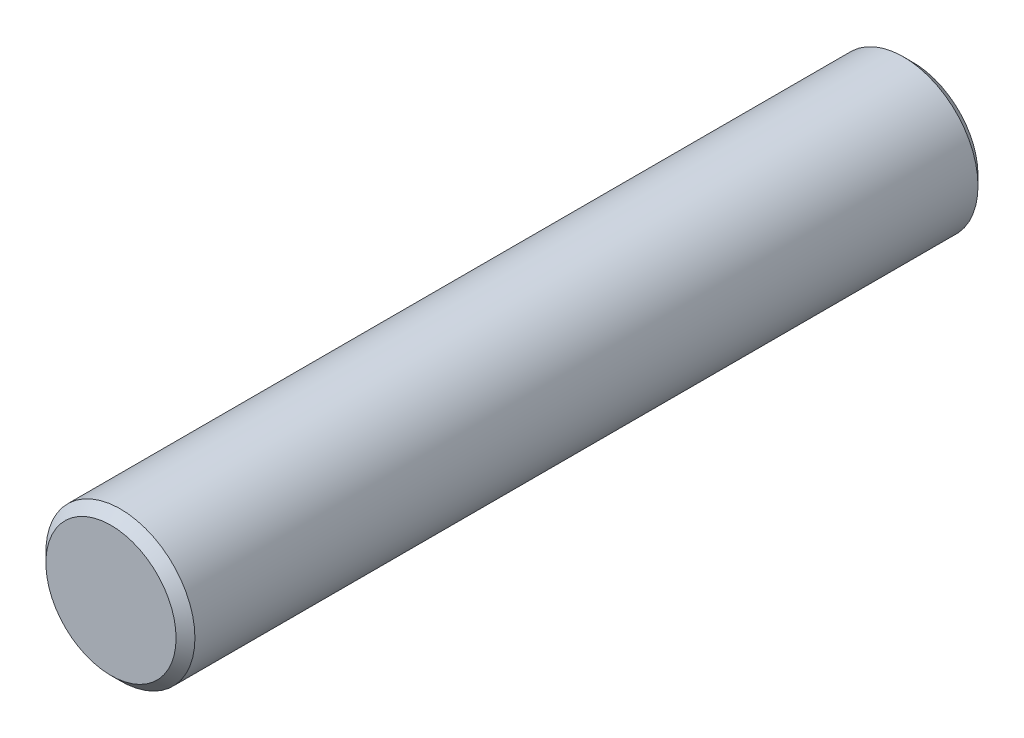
ISO-10303-21;
HEADER;
FILE_DESCRIPTION(('STEP AP214'),'2;1');
FILE_NAME('part.step','',(''),(''),'','','');
FILE_SCHEMA(('AUTOMOTIVE_DESIGN { 1 0 10303 214 1 1 1 1 }'));
ENDSEC;
DATA;
#1=APPLICATION_CONTEXT('core data for automotive mechanical design processes');
#2=APPLICATION_PROTOCOL_DEFINITION('international standard','automotive_design',2000,#1);
#3=PRODUCT_CONTEXT('',#1,'mechanical');
#4=PRODUCT('Part','Part','',(#3));
#5=PRODUCT_RELATED_PRODUCT_CATEGORY('part','',(#4));
#6=PRODUCT_DEFINITION_FORMATION('','',#4);
#7=PRODUCT_DEFINITION_CONTEXT('part definition',#1,'design');
#8=PRODUCT_DEFINITION('design','',#6,#7);
#9=PRODUCT_DEFINITION_SHAPE('','',#8);
#10=(LENGTH_UNIT() NAMED_UNIT(*) SI_UNIT(.MILLI.,.METRE.));
#11=(NAMED_UNIT(*) PLANE_ANGLE_UNIT() SI_UNIT($,.RADIAN.));
#12=(NAMED_UNIT(*) SI_UNIT($,.STERADIAN.) SOLID_ANGLE_UNIT());
#13=UNCERTAINTY_MEASURE_WITH_UNIT(LENGTH_MEASURE(1.E-05),#10,'distance_accuracy_value','');
#14=(GEOMETRIC_REPRESENTATION_CONTEXT(3) GLOBAL_UNCERTAINTY_ASSIGNED_CONTEXT((#13)) GLOBAL_UNIT_ASSIGNED_CONTEXT((#10,
#11,#12)) REPRESENTATION_CONTEXT('',''));
#15=CARTESIAN_POINT('',(0.,0.,0.));
#16=DIRECTION('',(0.,0.,1.));
#17=DIRECTION('',(1.,0.,0.));
#18=AXIS2_PLACEMENT_3D('',#15,#16,#17);
#19=CARTESIAN_POINT('',(0.,0.,8.5));
#20=DIRECTION('',(0.,0.,-1.));
#21=DIRECTION('',(-1.,0.,0.));
#22=AXIS2_PLACEMENT_3D('',#19,#20,#21);
#23=CYLINDRICAL_SURFACE('',#22,0.79);
#24=CARTESIAN_POINT('',(0.,0.,8.4));
#25=DIRECTION('',(0.,0.,1.));
#26=DIRECTION('',(1.,0.,0.));
#27=AXIS2_PLACEMENT_3D('',#24,#25,#26);
#28=CIRCLE('',#27,0.79);
#29=CARTESIAN_POINT('',(0.79,0.,8.4));
#30=VERTEX_POINT('',#29);
#31=EDGE_CURVE('E41',#30,#30,#28,.F.);
#32=ORIENTED_EDGE('',*,*,#31,.T.);
#33=EDGE_LOOP('',(#32));
#34=FACE_BOUND('',#33,.T.);
#35=CARTESIAN_POINT('',(0.,0.,0.100000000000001));
#36=DIRECTION('',(0.,0.,1.));
#37=DIRECTION('',(1.,0.,0.));
#38=AXIS2_PLACEMENT_3D('',#35,#36,#37);
#39=CIRCLE('',#38,0.79);
#40=CARTESIAN_POINT('',(0.79,0.,0.100000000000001));
#41=VERTEX_POINT('',#40);
#42=EDGE_CURVE('E45',#41,#41,#39,.T.);
#43=ORIENTED_EDGE('',*,*,#42,.T.);
#44=EDGE_LOOP('',(#43));
#45=FACE_BOUND('',#44,.T.);
#46=ADVANCED_FACE('F34',(#34,#45),#23,.T.);
#47=CARTESIAN_POINT('',(0.,0.,8.5));
#48=DIRECTION('',(0.,0.,1.));
#49=DIRECTION('',(1.,0.,0.));
#50=AXIS2_PLACEMENT_3D('',#47,#48,#49);
#51=PLANE('',#50);
#52=CARTESIAN_POINT('',(0.,0.,8.5));
#53=DIRECTION('',(0.,0.,1.));
#54=DIRECTION('',(1.,0.,0.));
#55=AXIS2_PLACEMENT_3D('',#52,#53,#54);
#56=CIRCLE('',#55,0.689999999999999);
#57=CARTESIAN_POINT('',(0.689999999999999,0.,8.5));
#58=VERTEX_POINT('',#57);
#59=EDGE_CURVE('E49',#58,#58,#56,.T.);
#60=ORIENTED_EDGE('',*,*,#59,.T.);
#61=EDGE_LOOP('',(#60));
#62=FACE_BOUND('',#61,.T.);
#63=ADVANCED_FACE('F55',(#62),#51,.T.);
#64=CARTESIAN_POINT('',(0.,0.,0.));
#65=DIRECTION('',(0.,0.,1.));
#66=DIRECTION('',(1.,0.,0.));
#67=AXIS2_PLACEMENT_3D('',#64,#65,#66);
#68=PLANE('',#67);
#69=CARTESIAN_POINT('',(0.,0.,0.));
#70=DIRECTION('',(0.,0.,1.));
#71=DIRECTION('',(1.,0.,0.));
#72=AXIS2_PLACEMENT_3D('',#69,#70,#71);
#73=CIRCLE('',#72,0.689999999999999);
#74=CARTESIAN_POINT('',(0.689999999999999,0.,0.));
#75=VERTEX_POINT('',#74);
#76=EDGE_CURVE('E10',#75,#75,#73,.F.);
#77=ORIENTED_EDGE('',*,*,#76,.T.);
#78=EDGE_LOOP('',(#77));
#79=FACE_BOUND('',#78,.T.);
#80=ADVANCED_FACE('F59',(#79),#68,.F.);
#81=CARTESIAN_POINT('',(0.,0.,8.5));
#82=DIRECTION('',(0.,0.,-1.));
#83=DIRECTION('',(-1.,0.,0.));
#84=AXIS2_PLACEMENT_3D('',#81,#82,#83);
#85=CONICAL_SURFACE('',#84,0.689999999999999,0.785398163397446);
#86=ORIENTED_EDGE('',*,*,#31,.F.);
#87=EDGE_LOOP('',(#86));
#88=FACE_BOUND('',#87,.T.);
#89=ORIENTED_EDGE('',*,*,#59,.F.);
#90=EDGE_LOOP('',(#89));
#91=FACE_BOUND('',#90,.T.);
#92=ADVANCED_FACE('F57',(#88,#91),#85,.T.);
#93=CARTESIAN_POINT('',(0.,0.,0.100000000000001));
#94=DIRECTION('',(0.,0.,1.));
#95=DIRECTION('',(1.,0.,0.));
#96=AXIS2_PLACEMENT_3D('',#93,#94,#95);
#97=CONICAL_SURFACE('',#96,0.79,0.785398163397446);
#98=ORIENTED_EDGE('',*,*,#76,.F.);
#99=EDGE_LOOP('',(#98));
#100=FACE_BOUND('',#99,.T.);
#101=ORIENTED_EDGE('',*,*,#42,.F.);
#102=EDGE_LOOP('',(#101));
#103=FACE_BOUND('',#102,.T.);
#104=ADVANCED_FACE('F36',(#100,#103),#97,.T.);
#105=CLOSED_SHELL('',(#46,#63,#80,#92,#104));
#106=MANIFOLD_SOLID_BREP('B2',#105);
#107=ADVANCED_BREP_SHAPE_REPRESENTATION('',(#18,#106),#14);
#108=SHAPE_DEFINITION_REPRESENTATION(#9,#107);
ENDSEC;
END-ISO-10303-21;
